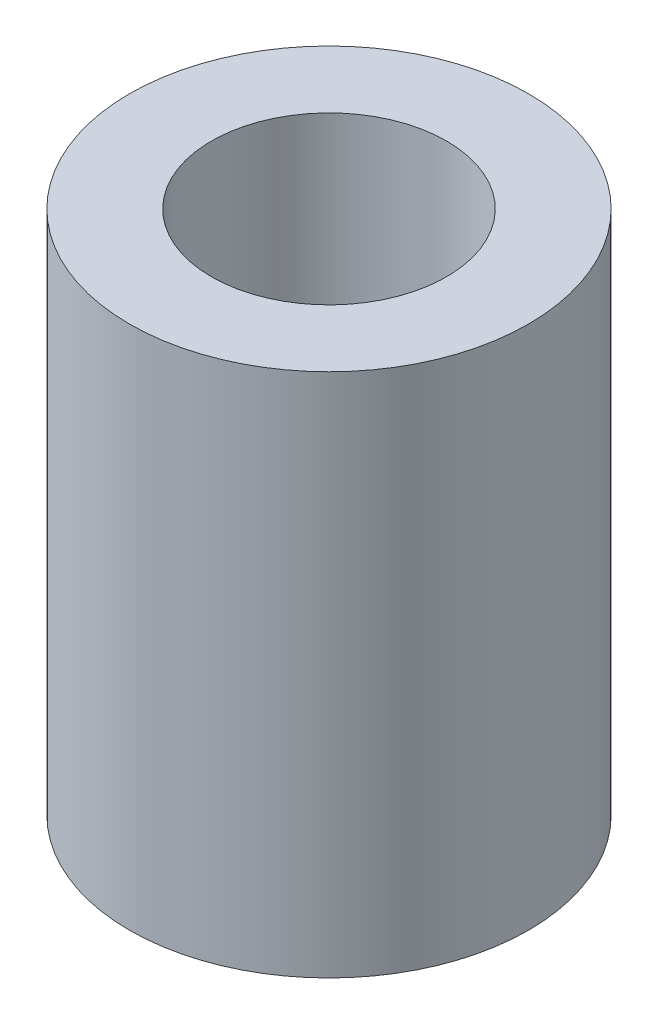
from build123d import *

# Parameters (mm, degrees)
SKETCH1_R             = 2.413
EXTRUDE1_DEPTH        = 6.35
F_4_40_TAPPED_HOLE1_D = 2.8448


with BuildPart() as part:
    # Sketch1 → Extrude1 (new body)
    with BuildSketch(Plane(origin=(0, 0, 0), x_dir=(1, 0, 0), z_dir=(0, 1, 0))):
        with Locations(Location((0, 0, 0), (0, 0, 270))):
            Circle(SKETCH1_R)
    extrude(amount=EXTRUDE1_DEPTH)

    # 4-40 Tapped Hole1 (through all)
    with Locations(Plane.ZX.offset(6.35)):
        with Locations((0, 0)):
            Hole(F_4_40_TAPPED_HOLE1_D / 2)


solid = part.part
